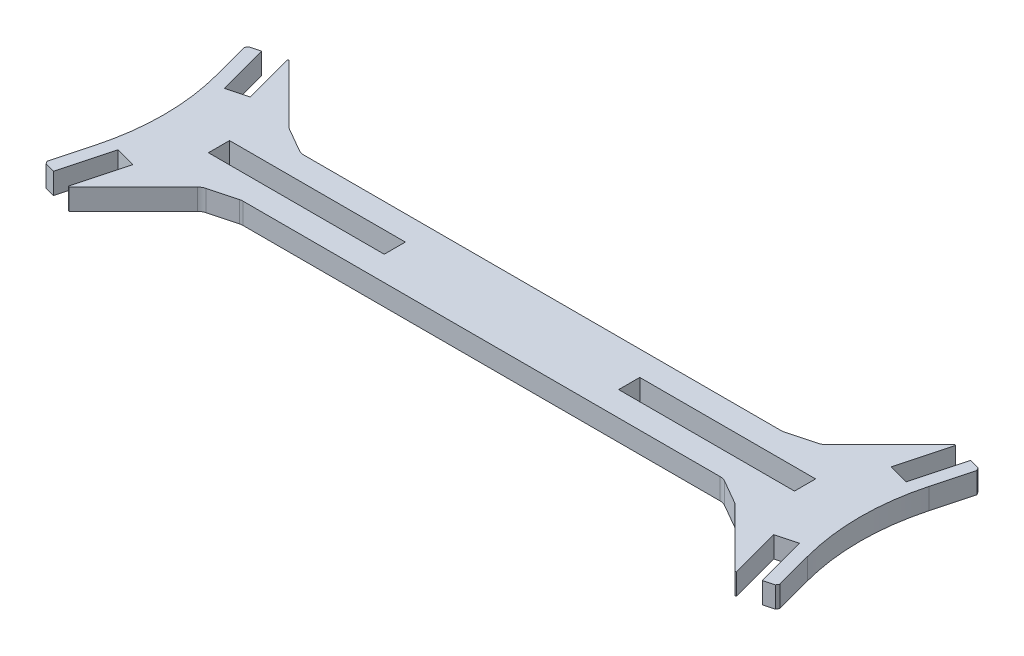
from build123d import *
from OCP.BRepFilletAPI import BRepFilletAPI_MakeChamfer

# Parameters (mm, degrees)
CROQUIS1_W              = 580
CROQUIS1_H              = 60
SALIENTE_EXTRUIR1_DEPTH = 18
CROQUIS2_W              = 150
CROQUIS2_H              = 18
CORTAR_EXTRUIR1_DEPTH   = 584.372951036
SALIENTE_EXTRUIR2_DEPTH = 18
REDONDEO1_R             = 200
CORTAR_EXTRUIR2_DEPTH   = 616.850984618
CHAFL_N1_SIZE           = 10
CHAFL_N1_SIZE2          = 19.318516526
REDONDEO2_R             = 10
CHAFL_N2_SIZE           = 2


with BuildPart() as part:
    # Croquis1 → Saliente-Extruir1 (new body)
    with BuildSketch(Plane(origin=(0, 0, 0), x_dir=(1, 0, 0), z_dir=(0, 1, 0))):
        with Locations((290, 30)):
            Rectangle(CROQUIS1_W, CROQUIS1_H)
    extrude(amount=SALIENTE_EXTRUIR1_DEPTH)

    # Croquis2 → Cortar-Extruir1 (cut, through all)
    with BuildSketch(Plane(origin=(0, 18, 0), x_dir=(1, 0, 0), z_dir=(0, 1, 0))):
        with Locations((115, 30)):
            Rectangle(CROQUIS2_W, CROQUIS2_H)
        with Locations((465, 30)):
            Rectangle(CROQUIS2_W, CROQUIS2_H)
    extrude(amount=-CORTAR_EXTRUIR1_DEPTH, mode=Mode.SUBTRACT)

    # Croquis3 → Saliente-Extruir2 (add)
    with BuildSketch(Plane(origin=(0, 0, 0), x_dir=(-1, 0, 0), z_dir=(0, -1, 0))):
        Polygon((0, 60), (0, 30), (23.029142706, 115.945930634), (-5.948632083, 123.710501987), (-69.65913407, 60), align=None)
        Polygon((-580, 60), (-510.34086593, 60), (-574.051367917, 123.710501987), (-603.029142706, 115.945930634), (-580, 30), align=None)
        Polygon((-574.051367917, -63.710501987), (-510.34086593, 0), (-580, 0), (-580, 30), (-603.029142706, -55.945930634), align=None)
        Polygon((23.029142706, -55.945930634), (0, 30), (0, 0), (-69.65913407, 0), (-5.948632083, -63.710501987), align=None)
    extrude(amount=-SALIENTE_EXTRUIR2_DEPTH)

    # Redondeo1
    redondeo1_edges = [part.edges().sort_by_distance(p)[0] for p in [
        (0, 9, -30),
        (580, 9, -30),
    ]]
    fillet(redondeo1_edges, radius=REDONDEO1_R)

    # Croquis4 → Cortar-Extruir2 (cut, through all)
    with BuildSketch(Plane(origin=(0, 0, 0), x_dir=(-1, 0, 0), z_dir=(0, -1, 0))):
        Polygon((-4.982706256, -63.451682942), (12.403958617, -58.79294013), (0.757101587, -15.326277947), (-16.629563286, -19.985020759), align=None)
        Polygon((12.403958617, 118.79294013), (-4.982706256, 123.451682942), (-16.629563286, 79.985020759), (0.757101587, 75.326277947), align=None)
        Polygon((-575.017293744, 123.451682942), (-592.403958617, 118.79294013), (-580.757101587, 75.326277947), (-563.370436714, 79.985020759), align=None)
        Polygon((-592.403958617, -58.79294013), (-575.017293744, -63.451682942), (-563.370436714, -19.985020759), (-580.757101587, -15.326277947), align=None)
    extrude(amount=-CORTAR_EXTRUIR2_DEPTH, mode=Mode.SUBTRACT)

    # Chafl_n1: one chamfer whose edges measure the first distance from different faces: ONE call of the kernel's chamfer builder (chamfer() names one face for all edges)
    chafl_n1_edges_1 = [part.edges().sort_by_distance(p)[0] for p in [
        (69.65913407, 9, -60),
    ]]
    chafl_n1_side_1 = [part.faces().sort_by_distance(p)[0] for p in [
        (290, 9, -60),
    ]]
    chafl_n1_edges_2 = [part.edges().sort_by_distance(p)[0] for p in [
        (510.34086593, 9, -60),
    ]]
    chafl_n1_side_2 = [part.faces().sort_by_distance(p)[0] for p in [
        (542.196116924, 9, -91.855250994),
    ]]
    chafl_n1_edges_3 = [part.edges().sort_by_distance(p)[0] for p in [
        (510.34086593, 9, 0),
    ]]
    chafl_n1_side_3 = [part.faces().sort_by_distance(p)[0] for p in [
        (290, 9, 0),
    ]]
    chafl_n1_edges_4 = [part.edges().sort_by_distance(p)[0] for p in [
        (69.65913407, 9, 0),
    ]]
    chafl_n1_side_4 = [part.faces().sort_by_distance(p)[0] for p in [
        (37.803883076, 9, 31.855250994),
    ]]
    chafl_n1 = BRepFilletAPI_MakeChamfer(part.part.solid().wrapped)
    for e in chafl_n1_edges_1:
        chafl_n1.Add(CHAFL_N1_SIZE, CHAFL_N1_SIZE2, e.wrapped, chafl_n1_side_1[0].wrapped)  # the first distance lies on this face
    for e in chafl_n1_edges_2:
        chafl_n1.Add(CHAFL_N1_SIZE, CHAFL_N1_SIZE2, e.wrapped, chafl_n1_side_2[0].wrapped)  # the first distance lies on this face
    for e in chafl_n1_edges_3:
        chafl_n1.Add(CHAFL_N1_SIZE, CHAFL_N1_SIZE2, e.wrapped, chafl_n1_side_3[0].wrapped)  # the first distance lies on this face
    for e in chafl_n1_edges_4:
        chafl_n1.Add(CHAFL_N1_SIZE, CHAFL_N1_SIZE2, e.wrapped, chafl_n1_side_4[0].wrapped)  # the first distance lies on this face
    add(Compound.cast(chafl_n1.Shape()), mode=Mode.REPLACE)

    # Redondeo2
    redondeo2_edges = [part.edges().sort_by_distance(p)[0] for p in [
        (55.998880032, 9, -73.660254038),
        (491.022349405, 9, -60),
        (79.65913407, 9, -60),
        (517.411933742, 9, -67.071067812),
        (524.001119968, 9, 13.660254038),
        (88.977650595, 9, 0),
        (500.34086593, 9, 0),
        (62.588066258, 9, 7.071067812),
    ]]
    fillet(redondeo2_edges, radius=REDONDEO2_R)

    # Chafl_n2
    chafl_n2_edges = [part.edges().sort_by_distance(p)[0] for p in [
        (-23.029142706, 9, -115.945930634),
        (603.029142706, 9, -115.945930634),
        (603.029142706, 9, 55.945930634),
        (-23.029142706, 9, 55.945930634),
    ]]
    chamfer(chafl_n2_edges, length=CHAFL_N2_SIZE)


solid = part.part
